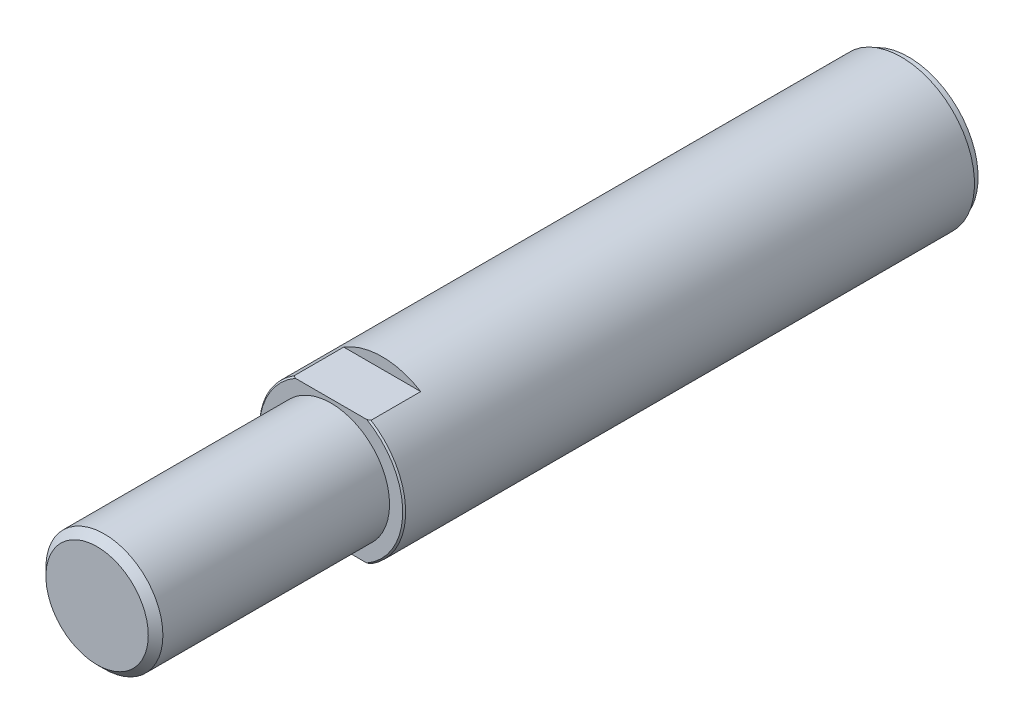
from build123d import *

# Parameters (mm, degrees)
ESBO_O1_R                      = 10
RESSALTO_EXTRUS_O1_DEPTH       = 111
ESBO_O2_OUTSIDE_W              = 44.91
ESBO_O2_OUTSIDE_H              = 44.91
ESBO_O2_OUTSIDE_R              = 8
CORTE_EXTRUS_O1_DEPTH          = 32
FURO_ROSCADO_DE_M10X1_51_D     = 8.5
FURO_ROSCADO_DE_M10X1_51_DEPTH = 27.5
FURO_ROSCADO_DE_M10X1_51_TIP   = 2.553657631
ESBO_O6_OUTSIDE_W              = 44.91
ESBO_O6_OUTSIDE_H              = 44.91
ESBO_O6_OUTSIDE_R              = 9.5
CORTE_EXTRUS_O2_DEPTH          = 1
CHANFRO1_SIZE                  = 1
CHANFRO2_SIZE                  = 0.2
ESBO_O7_OUTSIDE_W              = 44.91
ESBO_O7_OUTSIDE_H              = 44.91
ESBO_O7_OUTSIDE_W_2            = 31.474108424
ESBO_O7_OUTSIDE_H_2            = 17
CORTE_EXTRUS_O3_DEPTH          = 7


with BuildPart() as part:
    # Esbo_o1 → Ressalto-extrus_o1 (new body)
    with BuildSketch(Plane.XY):
        Circle(ESBO_O1_R)
    extrude(amount=RESSALTO_EXTRUS_O1_DEPTH)

    # Esbo_o2 outside → Corte-extrus_o1 (cut)
    with BuildSketch(Plane.XY.offset(111)):
        Rectangle(ESBO_O2_OUTSIDE_W, ESBO_O2_OUTSIDE_H)
        Circle(ESBO_O2_OUTSIDE_R, mode=Mode.SUBTRACT)
    extrude(amount=-CORTE_EXTRUS_O1_DEPTH, mode=Mode.SUBTRACT)

    # Furo roscado de M10x1.51
    with Locations(Plane(origin=(0, 0, 0), x_dir=(-1, 0, 0), z_dir=(0, 0, -1))):
        with Locations((0, 0)):
            Hole(FURO_ROSCADO_DE_M10X1_51_D / 2, depth=FURO_ROSCADO_DE_M10X1_51_DEPTH)
            with Locations((0, 0, -(FURO_ROSCADO_DE_M10X1_51_DEPTH + FURO_ROSCADO_DE_M10X1_51_TIP / 2))):  # 118° drill point
                Cone(0, FURO_ROSCADO_DE_M10X1_51_D / 2, FURO_ROSCADO_DE_M10X1_51_TIP, mode=Mode.SUBTRACT)

    # Esbo_o6 outside → Corte-extrus_o2 (cut)
    with BuildSketch(Plane(origin=(0, 0, 0), x_dir=(-1, 0, 0), z_dir=(0, 0, -1))):
        Rectangle(ESBO_O6_OUTSIDE_W, ESBO_O6_OUTSIDE_H)
        Circle(ESBO_O6_OUTSIDE_R, mode=Mode.SUBTRACT)
    extrude(amount=-CORTE_EXTRUS_O2_DEPTH, mode=Mode.SUBTRACT)

    # Chanfro1
    chanfro1_edges = [part.edges().sort_by_distance(p)[0] for p in [
        (-8, 0, 111),
    ]]
    chamfer(chanfro1_edges, length=CHANFRO1_SIZE)

    # Chanfro2
    chanfro2_edges = [part.edges().sort_by_distance(p)[0] for p in [
        (-10, 0, 79),
    ]]
    chamfer(chanfro2_edges, length=CHANFRO2_SIZE)

    # Esbo_o7 outside → Corte-extrus_o3 (cut)
    with BuildSketch(Plane.XY.offset(79)):
        Rectangle(ESBO_O7_OUTSIDE_W, ESBO_O7_OUTSIDE_H)
        Rectangle(ESBO_O7_OUTSIDE_W_2, ESBO_O7_OUTSIDE_H_2, mode=Mode.SUBTRACT)
    extrude(amount=-CORTE_EXTRUS_O3_DEPTH, mode=Mode.SUBTRACT)


solid = part.part
